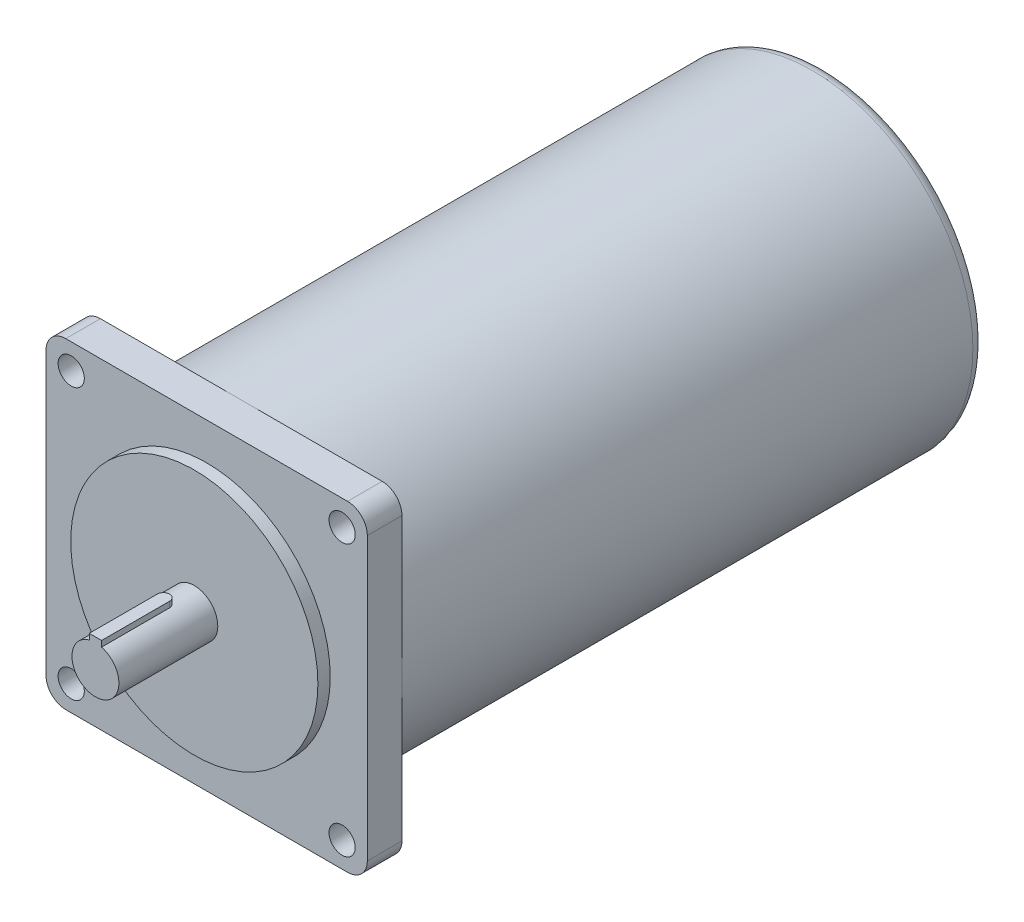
from build123d import *

# Parameters (mm, degrees)
SKETCH_1_R      = 50
EXTRUDE_1_DEPTH = 5
SKETCH_2_R      = 9.5
EXTRUDE_2_DEPTH = 40
EXTRUDE_3_DEPTH = 11.5
SKETCH_4_R      = 5.3
EXTRUDE_4_DEPTH = 14
SKETCH_6_R      = 65
EXTRUDE_5_DEPTH = 236
FILLET_1_R      = 5


with BuildPart() as part:
    # Sketch 1 → Extrude 1 (new body)
    with BuildSketch(Plane.XY):
        Circle(SKETCH_1_R)
    extrude(amount=-EXTRUDE_1_DEPTH)

    # Sketch 2 → Extrude 2 (add)
    with BuildSketch(Plane.XY):
        Circle(SKETCH_2_R)
    extrude(amount=EXTRUDE_2_DEPTH)

    # Sketch 3 → Extrude 3 (add)
    with BuildSketch(Plane(origin=(0, 0, 0), x_dir=(1, 0, 0), z_dir=(0, 1, 0))):
        with BuildLine():
            Line((-2.5, -12.5), (-2.5, -40))
            Line((-2.5, -40), (2.5, -40))
            Line((2.5, -40), (2.5, -12.5))
            ThreePointArc((2.5, -12.5), (0, -10), (-2.5, -12.5))
        make_face()
    extrude(amount=EXTRUDE_3_DEPTH)

    # Sketch 4 → Extrude 4 (add)
    with BuildSketch(Plane(origin=(0, 0, -5), x_dir=(-1, 0, 0), z_dir=(0, 0, -1))):
        with BuildLine():
            Line((0, 65), (57, 65))
            ThreePointArc((57, 65), (62.656854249, 62.656854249), (65, 57))
            Line((65, 57), (65, -57))
            ThreePointArc((65, -57), (62.656854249, -62.656854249), (57, -65))
            Line((57, -65), (-57, -65))
            ThreePointArc((-57, -65), (-62.656854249, -62.656854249), (-65, -57))
            Line((-65, -57), (-65, 57))
            ThreePointArc((-65, 57), (-62.656854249, 62.656854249), (-57, 65))
            Line((-57, 65), (0, 65))
        make_face()
        with Locations((-54.8, 54.8)):
            Circle(SKETCH_4_R, mode=Mode.SUBTRACT)
        with Locations((54.8, 54.8)):
            Circle(SKETCH_4_R, mode=Mode.SUBTRACT)
        with Locations((54.8, -54.8)):
            Circle(SKETCH_4_R, mode=Mode.SUBTRACT)
        with Locations((-54.8, -54.8)):
            Circle(SKETCH_4_R, mode=Mode.SUBTRACT)
    extrude(amount=EXTRUDE_4_DEPTH)

    # Sketch 6 → Extrude 5 (add)
    with BuildSketch(Plane(origin=(0, 0, -19), x_dir=(-1, 0, 0), z_dir=(0, 0, -1))):
        Circle(SKETCH_6_R)
    extrude(amount=EXTRUDE_5_DEPTH)

    # Fillet 1
    fillet_1_edges = [part.edges().sort_by_distance(p)[0] for p in [
        (65, 0, -255),
    ]]
    fillet(fillet_1_edges, radius=FILLET_1_R)


solid = part.part
